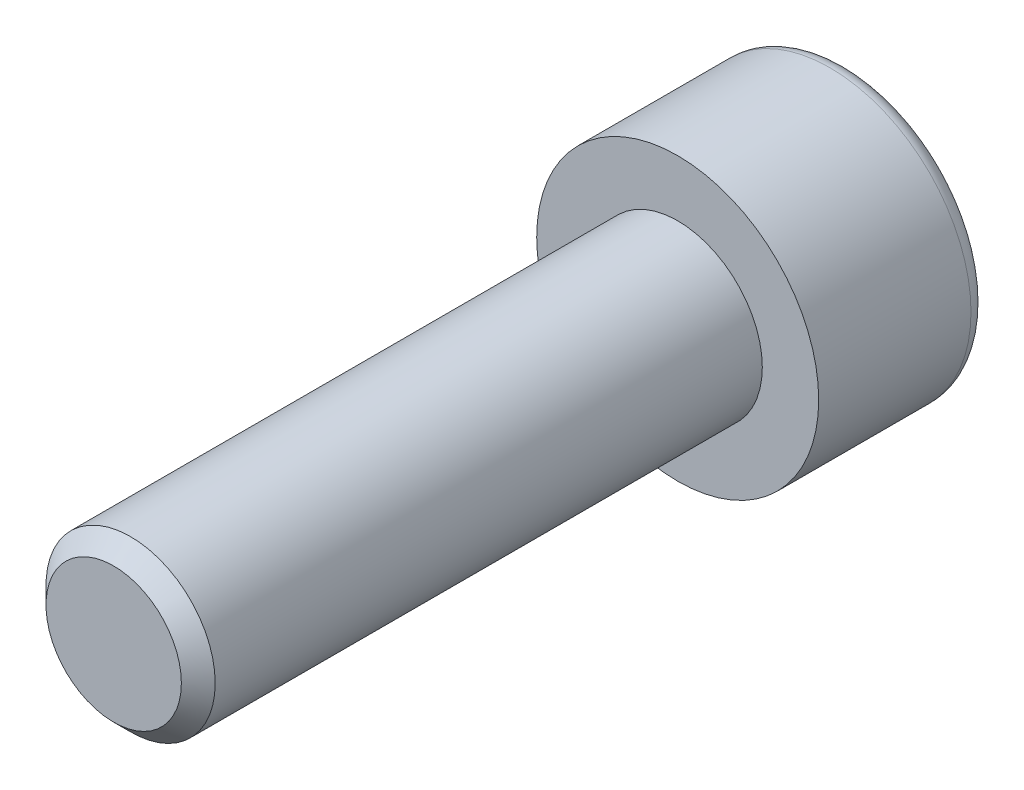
from build123d import *

# Parameters (mm, degrees)
ENLEV_MAT_EXTRU1_DEPTH = 3
ESQUISSE3_W            = 3
ESQUISSE3_H            = 20
CHANFREIN1_SIZE        = 0.6


with BuildPart() as part:
    # Esquisse1 → Base-R_volution (revolve)
    with BuildSketch(Plane(origin=(0, 0, 0), x_dir=(1, 0, 0), z_dir=(0, 1, 0)), mode=Mode.PRIVATE) as base_r_volution_sk:
        with BuildLine():
            Line((0, 0), (5, 0))
            Line((5, 0), (5, 5.4))
            ThreePointArc((5, 5.4), (4.824264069, 5.824264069), (4.4, 6))
            Line((4.4, 6), (0, 6))
            Line((0, 6), (0, 0))
        make_face()
    revolve(base_r_volution_sk.sketch.rotate(Axis((0, 0, 0), (0, 0, -1)), 180), axis=Axis((0, 0, 0), (0, 0, -1)))

    # Esquisse2 → enlev-mat-Extru1 (cut)
    with BuildSketch(Plane.XY.offset(-6)):
        Polygon((2.5, -1.443375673), (2.5, 1.443375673), (0, 2.886751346), (-2.5, 1.443375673), (-2.5, -1.443375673), (0, -2.886751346), align=None)
    extrude(amount=ENLEV_MAT_EXTRU1_DEPTH, mode=Mode.SUBTRACT)

    # Esquisse3 → Boss.-R_vol.1 (revolve)
    with BuildSketch(Plane(origin=(0, 0, 0), x_dir=(1, 0, 0), z_dir=(0, 1, 0))):
        with Locations((1.5, -10)):
            Rectangle(ESQUISSE3_W, ESQUISSE3_H)
    revolve(axis=Axis((0, 0, 0), (0, 0, 1)))

    # Chanfrein1
    chanfrein1_edges = [part.edges().sort_by_distance(p)[0] for p in [
        (-3, 0, 20),
    ]]
    chamfer(chanfrein1_edges, length=CHANFREIN1_SIZE)


solid = part.part
